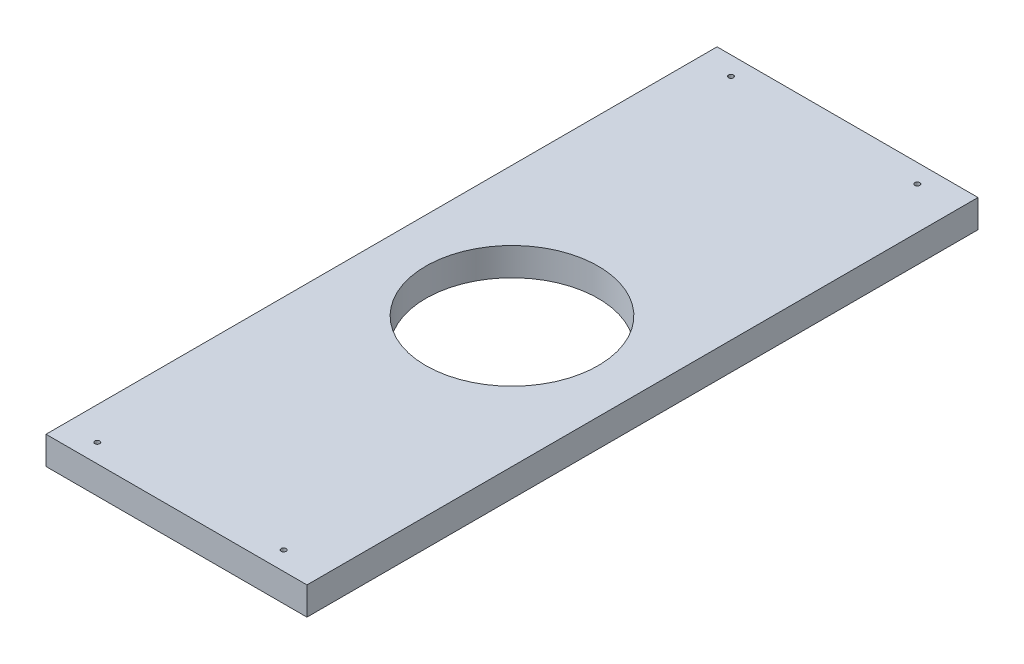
ISO-10303-21;
HEADER;
FILE_DESCRIPTION(('STEP AP214'),'2;1');
FILE_NAME('part.step','',(''),(''),'','','');
FILE_SCHEMA(('AUTOMOTIVE_DESIGN { 1 0 10303 214 1 1 1 1 }'));
ENDSEC;
DATA;
#1=APPLICATION_CONTEXT('core data for automotive mechanical design processes');
#2=APPLICATION_PROTOCOL_DEFINITION('international standard','automotive_design',2000,#1);
#3=PRODUCT_CONTEXT('',#1,'mechanical');
#4=PRODUCT('Part','Part','',(#3));
#5=PRODUCT_RELATED_PRODUCT_CATEGORY('part','',(#4));
#6=PRODUCT_DEFINITION_FORMATION('','',#4);
#7=PRODUCT_DEFINITION_CONTEXT('part definition',#1,'design');
#8=PRODUCT_DEFINITION('design','',#6,#7);
#9=PRODUCT_DEFINITION_SHAPE('','',#8);
#10=(LENGTH_UNIT() NAMED_UNIT(*) SI_UNIT(.MILLI.,.METRE.));
#11=(NAMED_UNIT(*) PLANE_ANGLE_UNIT() SI_UNIT($,.RADIAN.));
#12=(NAMED_UNIT(*) SI_UNIT($,.STERADIAN.) SOLID_ANGLE_UNIT());
#13=UNCERTAINTY_MEASURE_WITH_UNIT(LENGTH_MEASURE(1.E-05),#10,'distance_accuracy_value','');
#14=(GEOMETRIC_REPRESENTATION_CONTEXT(3) GLOBAL_UNCERTAINTY_ASSIGNED_CONTEXT((#13)) GLOBAL_UNIT_ASSIGNED_CONTEXT((#10,
#11,#12)) REPRESENTATION_CONTEXT('',''));
#15=CARTESIAN_POINT('',(0.,0.,0.));
#16=DIRECTION('',(0.,0.,1.));
#17=DIRECTION('',(1.,0.,0.));
#18=AXIS2_PLACEMENT_3D('',#15,#16,#17);
#19=CARTESIAN_POINT('',(-177.8,-38.1,457.2));
#20=DIRECTION('',(-1.,0.,0.));
#21=DIRECTION('',(0.,0.,1.));
#22=AXIS2_PLACEMENT_3D('',#19,#20,#21);
#23=PLANE('',#22);
#24=DIRECTION('',(0.,0.,1.));
#25=VECTOR('',#24,1.);
#26=CARTESIAN_POINT('',(-177.8,0.,457.2));
#27=LINE('',#26,#25);
#28=CARTESIAN_POINT('',(-177.8,0.,-457.2));
#29=VERTEX_POINT('',#28);
#30=CARTESIAN_POINT('',(-177.8,0.,457.2));
#31=VERTEX_POINT('',#30);
#32=EDGE_CURVE('E111',#29,#31,#27,.T.);
#33=ORIENTED_EDGE('',*,*,#32,.F.);
#34=DIRECTION('',(0.,1.,0.));
#35=VECTOR('',#34,1.);
#36=CARTESIAN_POINT('',(-177.8,-38.1,-457.2));
#37=LINE('',#36,#35);
#38=CARTESIAN_POINT('',(-177.8,-38.1,-457.2));
#39=VERTEX_POINT('',#38);
#40=EDGE_CURVE('E13',#39,#29,#37,.T.);
#41=ORIENTED_EDGE('',*,*,#40,.F.);
#42=DIRECTION('',(0.,0.,1.));
#43=VECTOR('',#42,1.);
#44=CARTESIAN_POINT('',(-177.8,-38.1,457.2));
#45=LINE('',#44,#43);
#46=CARTESIAN_POINT('',(-177.8,-38.1,457.2));
#47=VERTEX_POINT('',#46);
#48=EDGE_CURVE('E104',#39,#47,#45,.T.);
#49=ORIENTED_EDGE('',*,*,#48,.T.);
#50=DIRECTION('',(0.,1.,0.));
#51=VECTOR('',#50,1.);
#52=CARTESIAN_POINT('',(-177.8,-38.1,457.2));
#53=LINE('',#52,#51);
#54=EDGE_CURVE('E49',#47,#31,#53,.T.);
#55=ORIENTED_EDGE('',*,*,#54,.T.);
#56=EDGE_LOOP('',(#33,#41,#49,#55));
#57=FACE_BOUND('',#56,.T.);
#58=ADVANCED_FACE('F46',(#57),#23,.T.);
#59=CARTESIAN_POINT('',(-177.8,-38.1,-457.2));
#60=DIRECTION('',(0.,0.,-1.));
#61=DIRECTION('',(-1.,0.,0.));
#62=AXIS2_PLACEMENT_3D('',#59,#60,#61);
#63=PLANE('',#62);
#64=DIRECTION('',(-1.,0.,0.));
#65=VECTOR('',#64,1.);
#66=CARTESIAN_POINT('',(-177.8,0.,-457.2));
#67=LINE('',#66,#65);
#68=CARTESIAN_POINT('',(177.8,0.,-457.200000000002));
#69=VERTEX_POINT('',#68);
#70=EDGE_CURVE('E106',#69,#29,#67,.T.);
#71=ORIENTED_EDGE('',*,*,#70,.F.);
#72=DIRECTION('',(0.,1.,0.));
#73=VECTOR('',#72,1.);
#74=CARTESIAN_POINT('',(177.8,-38.1,-457.200000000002));
#75=LINE('',#74,#73);
#76=CARTESIAN_POINT('',(177.8,-38.1,-457.200000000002));
#77=VERTEX_POINT('',#76);
#78=EDGE_CURVE('E55',#77,#69,#75,.T.);
#79=ORIENTED_EDGE('',*,*,#78,.F.);
#80=DIRECTION('',(-1.,0.,0.));
#81=VECTOR('',#80,1.);
#82=CARTESIAN_POINT('',(-177.8,-38.1,-457.2));
#83=LINE('',#82,#81);
#84=EDGE_CURVE('E101',#77,#39,#83,.T.);
#85=ORIENTED_EDGE('',*,*,#84,.T.);
#86=ORIENTED_EDGE('',*,*,#40,.T.);
#87=EDGE_LOOP('',(#71,#79,#85,#86));
#88=FACE_BOUND('',#87,.T.);
#89=ADVANCED_FACE('F122',(#88),#63,.T.);
#90=CARTESIAN_POINT('',(177.8,-38.1,457.2));
#91=DIRECTION('',(1.,0.,0.));
#92=DIRECTION('',(0.,0.,-1.));
#93=AXIS2_PLACEMENT_3D('',#90,#91,#92);
#94=PLANE('',#93);
#95=DIRECTION('',(0.,0.,-1.));
#96=VECTOR('',#95,1.);
#97=CARTESIAN_POINT('',(177.8,0.,457.2));
#98=LINE('',#97,#96);
#99=CARTESIAN_POINT('',(177.8,0.,457.2));
#100=VERTEX_POINT('',#99);
#101=EDGE_CURVE('E96',#100,#69,#98,.T.);
#102=ORIENTED_EDGE('',*,*,#101,.F.);
#103=DIRECTION('',(0.,1.,0.));
#104=VECTOR('',#103,1.);
#105=CARTESIAN_POINT('',(177.8,-38.1,457.2));
#106=LINE('',#105,#104);
#107=CARTESIAN_POINT('',(177.8,-38.1,457.2));
#108=VERTEX_POINT('',#107);
#109=EDGE_CURVE('E91',#108,#100,#106,.T.);
#110=ORIENTED_EDGE('',*,*,#109,.F.);
#111=DIRECTION('',(0.,0.,-1.));
#112=VECTOR('',#111,1.);
#113=CARTESIAN_POINT('',(177.8,-38.1,457.2));
#114=LINE('',#113,#112);
#115=EDGE_CURVE('E94',#108,#77,#114,.T.);
#116=ORIENTED_EDGE('',*,*,#115,.T.);
#117=ORIENTED_EDGE('',*,*,#78,.T.);
#118=EDGE_LOOP('',(#102,#110,#116,#117));
#119=FACE_BOUND('',#118,.T.);
#120=ADVANCED_FACE('F93',(#119),#94,.T.);
#121=CARTESIAN_POINT('',(-177.8,-38.1,457.2));
#122=DIRECTION('',(0.,0.,1.));
#123=DIRECTION('',(1.,0.,0.));
#124=AXIS2_PLACEMENT_3D('',#121,#122,#123);
#125=PLANE('',#124);
#126=DIRECTION('',(1.,0.,0.));
#127=VECTOR('',#126,1.);
#128=CARTESIAN_POINT('',(-177.8,0.,457.2));
#129=LINE('',#128,#127);
#130=EDGE_CURVE('E114',#31,#100,#129,.T.);
#131=ORIENTED_EDGE('',*,*,#130,.F.);
#132=ORIENTED_EDGE('',*,*,#54,.F.);
#133=DIRECTION('',(1.,0.,0.));
#134=VECTOR('',#133,1.);
#135=CARTESIAN_POINT('',(-177.8,-38.1,457.2));
#136=LINE('',#135,#134);
#137=EDGE_CURVE('E100',#47,#108,#136,.T.);
#138=ORIENTED_EDGE('',*,*,#137,.T.);
#139=ORIENTED_EDGE('',*,*,#109,.T.);
#140=EDGE_LOOP('',(#131,#132,#138,#139));
#141=FACE_BOUND('',#140,.T.);
#142=ADVANCED_FACE('F103',(#141),#125,.T.);
#143=CARTESIAN_POINT('',(0.,-38.1,0.));
#144=DIRECTION('',(0.,-1.,0.));
#145=DIRECTION('',(0.,0.,-1.));
#146=AXIS2_PLACEMENT_3D('',#143,#144,#145);
#147=PLANE('',#146);
#148=CARTESIAN_POINT('',(-133.349999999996,-38.1,431.8));
#149=DIRECTION('',(0.,1.,0.));
#150=DIRECTION('',(0.,0.,1.));
#151=AXIS2_PLACEMENT_3D('',#148,#149,#150);
#152=CIRCLE('',#151,3.3782);
#153=CARTESIAN_POINT('',(-133.349999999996,-38.1,435.1782));
#154=VERTEX_POINT('',#153);
#155=EDGE_CURVE('E167',#154,#154,#152,.T.);
#156=ORIENTED_EDGE('',*,*,#155,.T.);
#157=EDGE_LOOP('',(#156));
#158=FACE_BOUND('',#157,.T.);
#159=CARTESIAN_POINT('',(120.650000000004,-38.1,431.8));
#160=DIRECTION('',(0.,1.,0.));
#161=DIRECTION('',(0.,0.,1.));
#162=AXIS2_PLACEMENT_3D('',#159,#160,#161);
#163=CIRCLE('',#162,3.3782);
#164=CARTESIAN_POINT('',(120.650000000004,-38.1,435.1782));
#165=VERTEX_POINT('',#164);
#166=EDGE_CURVE('E177',#165,#165,#163,.T.);
#167=ORIENTED_EDGE('',*,*,#166,.T.);
#168=EDGE_LOOP('',(#167));
#169=FACE_BOUND('',#168,.T.);
#170=CARTESIAN_POINT('',(-133.35,-38.1,-431.8));
#171=DIRECTION('',(0.,1.,0.));
#172=DIRECTION('',(0.,0.,1.));
#173=AXIS2_PLACEMENT_3D('',#170,#171,#172);
#174=CIRCLE('',#173,3.3782);
#175=CARTESIAN_POINT('',(-133.35,-38.1,-428.4218));
#176=VERTEX_POINT('',#175);
#177=EDGE_CURVE('E183',#176,#176,#174,.T.);
#178=ORIENTED_EDGE('',*,*,#177,.T.);
#179=EDGE_LOOP('',(#178));
#180=FACE_BOUND('',#179,.T.);
#181=CARTESIAN_POINT('',(120.65,-38.1,-431.8));
#182=DIRECTION('',(0.,1.,0.));
#183=DIRECTION('',(0.,0.,1.));
#184=AXIS2_PLACEMENT_3D('',#181,#182,#183);
#185=CIRCLE('',#184,3.3782);
#186=CARTESIAN_POINT('',(120.65,-38.1,-428.4218));
#187=VERTEX_POINT('',#186);
#188=EDGE_CURVE('E189',#187,#187,#185,.T.);
#189=ORIENTED_EDGE('',*,*,#188,.T.);
#190=EDGE_LOOP('',(#189));
#191=FACE_BOUND('',#190,.T.);
#192=CARTESIAN_POINT('',(0.,-38.1,0.));
#193=DIRECTION('',(0.,1.,0.));
#194=DIRECTION('',(0.,0.,1.));
#195=AXIS2_PLACEMENT_3D('',#192,#193,#194);
#196=CIRCLE('',#195,117.475);
#197=CARTESIAN_POINT('',(0.,-38.1,117.475));
#198=VERTEX_POINT('',#197);
#199=EDGE_CURVE('E115',#198,#198,#196,.T.);
#200=ORIENTED_EDGE('',*,*,#199,.T.);
#201=EDGE_LOOP('',(#200));
#202=FACE_BOUND('',#201,.T.);
#203=ORIENTED_EDGE('',*,*,#48,.F.);
#204=ORIENTED_EDGE('',*,*,#84,.F.);
#205=ORIENTED_EDGE('',*,*,#115,.F.);
#206=ORIENTED_EDGE('',*,*,#137,.F.);
#207=EDGE_LOOP('',(#203,#204,#205,#206));
#208=FACE_BOUND('',#207,.T.);
#209=ADVANCED_FACE('F99',(#158,#169,#180,#191,#202,#208),#147,.T.);
#210=CARTESIAN_POINT('',(0.,0.,0.));
#211=DIRECTION('',(0.,-1.,0.));
#212=DIRECTION('',(0.,0.,-1.));
#213=AXIS2_PLACEMENT_3D('',#210,#211,#212);
#214=PLANE('',#213);
#215=CARTESIAN_POINT('',(-133.349999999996,0.,431.8));
#216=DIRECTION('',(0.,1.,0.));
#217=DIRECTION('',(0.,0.,1.));
#218=AXIS2_PLACEMENT_3D('',#215,#216,#217);
#219=CIRCLE('',#218,3.3782);
#220=CARTESIAN_POINT('',(-133.349999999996,0.,435.1782));
#221=VERTEX_POINT('',#220);
#222=EDGE_CURVE('E170',#221,#221,#219,.T.);
#223=ORIENTED_EDGE('',*,*,#222,.F.);
#224=EDGE_LOOP('',(#223));
#225=FACE_BOUND('',#224,.T.);
#226=CARTESIAN_POINT('',(120.650000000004,0.,431.8));
#227=DIRECTION('',(0.,1.,0.));
#228=DIRECTION('',(0.,0.,1.));
#229=AXIS2_PLACEMENT_3D('',#226,#227,#228);
#230=CIRCLE('',#229,3.3782);
#231=CARTESIAN_POINT('',(120.650000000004,0.,435.1782));
#232=VERTEX_POINT('',#231);
#233=EDGE_CURVE('E172',#232,#232,#230,.T.);
#234=ORIENTED_EDGE('',*,*,#233,.F.);
#235=EDGE_LOOP('',(#234));
#236=FACE_BOUND('',#235,.T.);
#237=CARTESIAN_POINT('',(-133.35,0.,-431.8));
#238=DIRECTION('',(0.,1.,0.));
#239=DIRECTION('',(0.,0.,1.));
#240=AXIS2_PLACEMENT_3D('',#237,#238,#239);
#241=CIRCLE('',#240,3.3782);
#242=CARTESIAN_POINT('',(-133.35,0.,-428.4218));
#243=VERTEX_POINT('',#242);
#244=EDGE_CURVE('E180',#243,#243,#241,.T.);
#245=ORIENTED_EDGE('',*,*,#244,.F.);
#246=EDGE_LOOP('',(#245));
#247=FACE_BOUND('',#246,.T.);
#248=CARTESIAN_POINT('',(120.65,0.,-431.8));
#249=DIRECTION('',(0.,1.,0.));
#250=DIRECTION('',(0.,0.,1.));
#251=AXIS2_PLACEMENT_3D('',#248,#249,#250);
#252=CIRCLE('',#251,3.3782);
#253=CARTESIAN_POINT('',(120.65,0.,-428.4218));
#254=VERTEX_POINT('',#253);
#255=EDGE_CURVE('E186',#254,#254,#252,.T.);
#256=ORIENTED_EDGE('',*,*,#255,.F.);
#257=EDGE_LOOP('',(#256));
#258=FACE_BOUND('',#257,.T.);
#259=CARTESIAN_POINT('',(0.,0.,0.));
#260=DIRECTION('',(0.,1.,0.));
#261=DIRECTION('',(0.,0.,1.));
#262=AXIS2_PLACEMENT_3D('',#259,#260,#261);
#263=CIRCLE('',#262,117.475);
#264=CARTESIAN_POINT('',(0.,0.,117.475));
#265=VERTEX_POINT('',#264);
#266=EDGE_CURVE('E192',#265,#265,#263,.T.);
#267=ORIENTED_EDGE('',*,*,#266,.F.);
#268=EDGE_LOOP('',(#267));
#269=FACE_BOUND('',#268,.T.);
#270=ORIENTED_EDGE('',*,*,#32,.T.);
#271=ORIENTED_EDGE('',*,*,#130,.T.);
#272=ORIENTED_EDGE('',*,*,#101,.T.);
#273=ORIENTED_EDGE('',*,*,#70,.T.);
#274=EDGE_LOOP('',(#270,#271,#272,#273));
#275=FACE_BOUND('',#274,.T.);
#276=ADVANCED_FACE('F121',(#225,#236,#247,#258,#269,#275),#214,.F.);
#277=CARTESIAN_POINT('',(0.,-38.1,0.));
#278=DIRECTION('',(0.,1.,0.));
#279=DIRECTION('',(0.,0.,1.));
#280=AXIS2_PLACEMENT_3D('',#277,#278,#279);
#281=CYLINDRICAL_SURFACE('',#280,117.475);
#282=CARTESIAN_POINT('',(0.,-38.1,117.475));
#283=CARTESIAN_POINT('',(0.,-37.703125,117.475));
#284=CARTESIAN_POINT('',(0.,-37.30625,117.475));
#285=CARTESIAN_POINT('',(0.,-36.5125,117.475));
#286=CARTESIAN_POINT('',(0.,-36.115625,117.475));
#287=CARTESIAN_POINT('',(0.,-35.321875,117.475));
#288=CARTESIAN_POINT('',(0.,-34.925,117.475));
#289=CARTESIAN_POINT('',(0.,-34.13125,117.475));
#290=CARTESIAN_POINT('',(0.,-33.734375,117.475));
#291=CARTESIAN_POINT('',(0.,-32.940625,117.475));
#292=CARTESIAN_POINT('',(0.,-32.54375,117.475));
#293=CARTESIAN_POINT('',(0.,-31.75,117.475));
#294=CARTESIAN_POINT('',(0.,-31.353125,117.475));
#295=CARTESIAN_POINT('',(0.,-30.559375,117.475));
#296=CARTESIAN_POINT('',(0.,-30.1625,117.475));
#297=CARTESIAN_POINT('',(0.,-29.36875,117.475));
#298=CARTESIAN_POINT('',(0.,-28.971875,117.475));
#299=CARTESIAN_POINT('',(0.,-28.178125,117.475));
#300=CARTESIAN_POINT('',(0.,-27.78125,117.475));
#301=CARTESIAN_POINT('',(0.,-26.9875,117.475));
#302=CARTESIAN_POINT('',(0.,-26.590625,117.475));
#303=CARTESIAN_POINT('',(0.,-25.796875,117.475));
#304=CARTESIAN_POINT('',(0.,-25.4,117.475));
#305=CARTESIAN_POINT('',(0.,-24.60625,117.475));
#306=CARTESIAN_POINT('',(0.,-24.209375,117.475));
#307=CARTESIAN_POINT('',(0.,-23.415625,117.475));
#308=CARTESIAN_POINT('',(0.,-23.01875,117.475));
#309=CARTESIAN_POINT('',(0.,-22.225,117.475));
#310=CARTESIAN_POINT('',(0.,-21.828125,117.475));
#311=CARTESIAN_POINT('',(0.,-21.034375,117.475));
#312=CARTESIAN_POINT('',(0.,-20.6375,117.475));
#313=CARTESIAN_POINT('',(0.,-19.84375,117.475));
#314=CARTESIAN_POINT('',(0.,-19.446875,117.475));
#315=CARTESIAN_POINT('',(0.,-18.653125,117.475));
#316=CARTESIAN_POINT('',(0.,-18.25625,117.475));
#317=CARTESIAN_POINT('',(0.,-17.4625,117.475));
#318=CARTESIAN_POINT('',(0.,-17.065625,117.475));
#319=CARTESIAN_POINT('',(0.,-16.271875,117.475));
#320=CARTESIAN_POINT('',(0.,-15.875,117.475));
#321=CARTESIAN_POINT('',(0.,-15.08125,117.475));
#322=CARTESIAN_POINT('',(0.,-14.684375,117.475));
#323=CARTESIAN_POINT('',(0.,-13.890625,117.475));
#324=CARTESIAN_POINT('',(0.,-13.49375,117.475));
#325=CARTESIAN_POINT('',(0.,-12.7,117.475));
#326=CARTESIAN_POINT('',(0.,-12.303125,117.475));
#327=CARTESIAN_POINT('',(0.,-11.509375,117.475));
#328=CARTESIAN_POINT('',(0.,-11.1125,117.475));
#329=CARTESIAN_POINT('',(0.,-10.31875,117.475));
#330=CARTESIAN_POINT('',(0.,-9.921875,117.475));
#331=CARTESIAN_POINT('',(0.,-9.128125,117.475));
#332=CARTESIAN_POINT('',(0.,-8.73125,117.475));
#333=CARTESIAN_POINT('',(0.,-7.9375,117.475));
#334=CARTESIAN_POINT('',(0.,-7.540625,117.475));
#335=CARTESIAN_POINT('',(0.,-6.746875,117.475));
#336=CARTESIAN_POINT('',(0.,-6.35,117.475));
#337=CARTESIAN_POINT('',(0.,-5.55625,117.475));
#338=CARTESIAN_POINT('',(0.,-5.159375,117.475));
#339=CARTESIAN_POINT('',(0.,-4.365625,117.475));
#340=CARTESIAN_POINT('',(0.,-3.96875,117.475));
#341=CARTESIAN_POINT('',(0.,-3.17499999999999,117.475));
#342=CARTESIAN_POINT('',(0.,-2.77812499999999,117.475));
#343=CARTESIAN_POINT('',(0.,-1.98437499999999,117.475));
#344=CARTESIAN_POINT('',(0.,-1.58749999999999,117.475));
#345=CARTESIAN_POINT('',(0.,-0.793749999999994,117.475));
#346=CARTESIAN_POINT('',(0.,-0.396874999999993,117.475));
#347=CARTESIAN_POINT('',(0.,0.,117.475));
#348=B_SPLINE_CURVE_WITH_KNOTS('',3,(#282,#283,#284,#285,#286,#287,#288,#289,#290,#291,#292,
#293,#294,#295,#296,#297,#298,#299,#300,#301,#302,#303,#304,#305,#306,#307,#308,#309,#310,#311,
#312,#313,#314,#315,#316,#317,#318,#319,#320,#321,#322,#323,#324,#325,#326,#327,#328,#329,#330,
#331,#332,#333,#334,#335,#336,#337,#338,#339,#340,#341,#342,#343,#344,#345,#346,#347),
.UNSPECIFIED.,.F.,.F.,(4,2,2,2,2,2,2,2,2,2,2,2,2,2,2,2,2,2,2,2,2,2,2,2,2,2,2,2,2,2,2,2,4),(0.,
1.19062499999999,2.38124999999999,3.571875,4.7625,5.953125,7.14375,8.334375,9.525,10.715625,
11.90625,13.096875,14.2875,15.478125,16.66875,17.859375,19.05,20.240625,21.43125,22.621875,
23.8125,25.003125,26.19375,27.384375,28.575,29.765625,30.95625,32.146875,33.3375,34.528125,
35.71875,36.909375,38.1),.UNSPECIFIED.);
#349=EDGE_CURVE('BSEAM140',#198,#265,#348,.T.);
#350=ORIENTED_EDGE('',*,*,#199,.F.);
#351=ORIENTED_EDGE('',*,*,#266,.T.);
#352=ORIENTED_EDGE('',*,*,#349,.T.);
#353=ORIENTED_EDGE('',*,*,#349,.F.);
#354=EDGE_LOOP('',(#350,#352,#351,#353));
#355=FACE_BOUND('',#354,.T.);
#356=ADVANCED_FACE('F140',(#355),#281,.F.);
#357=CARTESIAN_POINT('',(120.65,0.,-431.8));
#358=DIRECTION('',(0.,1.,0.));
#359=DIRECTION('',(0.,0.,1.));
#360=AXIS2_PLACEMENT_3D('',#357,#358,#359);
#361=CYLINDRICAL_SURFACE('',#360,3.3782);
#362=ORIENTED_EDGE('',*,*,#188,.F.);
#363=EDGE_LOOP('',(#362));
#364=FACE_BOUND('',#363,.T.);
#365=ORIENTED_EDGE('',*,*,#255,.T.);
#366=EDGE_LOOP('',(#365));
#367=FACE_BOUND('',#366,.T.);
#368=ADVANCED_FACE('F147',(#364,#367),#361,.F.);
#369=CARTESIAN_POINT('',(-133.35,0.,-431.8));
#370=DIRECTION('',(0.,1.,0.));
#371=DIRECTION('',(0.,0.,1.));
#372=AXIS2_PLACEMENT_3D('',#369,#370,#371);
#373=CYLINDRICAL_SURFACE('',#372,3.3782);
#374=ORIENTED_EDGE('',*,*,#177,.F.);
#375=EDGE_LOOP('',(#374));
#376=FACE_BOUND('',#375,.T.);
#377=ORIENTED_EDGE('',*,*,#244,.T.);
#378=EDGE_LOOP('',(#377));
#379=FACE_BOUND('',#378,.T.);
#380=ADVANCED_FACE('F151',(#376,#379),#373,.F.);
#381=CARTESIAN_POINT('',(120.650000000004,0.,431.8));
#382=DIRECTION('',(0.,1.,0.));
#383=DIRECTION('',(0.,0.,1.));
#384=AXIS2_PLACEMENT_3D('',#381,#382,#383);
#385=CYLINDRICAL_SURFACE('',#384,3.3782);
#386=ORIENTED_EDGE('',*,*,#166,.F.);
#387=EDGE_LOOP('',(#386));
#388=FACE_BOUND('',#387,.T.);
#389=ORIENTED_EDGE('',*,*,#233,.T.);
#390=EDGE_LOOP('',(#389));
#391=FACE_BOUND('',#390,.T.);
#392=ADVANCED_FACE('F155',(#388,#391),#385,.F.);
#393=CARTESIAN_POINT('',(-133.349999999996,0.,431.8));
#394=DIRECTION('',(0.,1.,0.));
#395=DIRECTION('',(0.,0.,1.));
#396=AXIS2_PLACEMENT_3D('',#393,#394,#395);
#397=CYLINDRICAL_SURFACE('',#396,3.3782);
#398=ORIENTED_EDGE('',*,*,#155,.F.);
#399=EDGE_LOOP('',(#398));
#400=FACE_BOUND('',#399,.T.);
#401=ORIENTED_EDGE('',*,*,#222,.T.);
#402=EDGE_LOOP('',(#401));
#403=FACE_BOUND('',#402,.T.);
#404=ADVANCED_FACE('F159',(#400,#403),#397,.F.);
#405=CLOSED_SHELL('',(#58,#89,#120,#142,#209,#276,#356,#368,#380,#392,#404));
#406=MANIFOLD_SOLID_BREP('B2',#405);
#407=ADVANCED_BREP_SHAPE_REPRESENTATION('',(#18,#406),#14);
#408=SHAPE_DEFINITION_REPRESENTATION(#9,#407);
ENDSEC;
END-ISO-10303-21;
